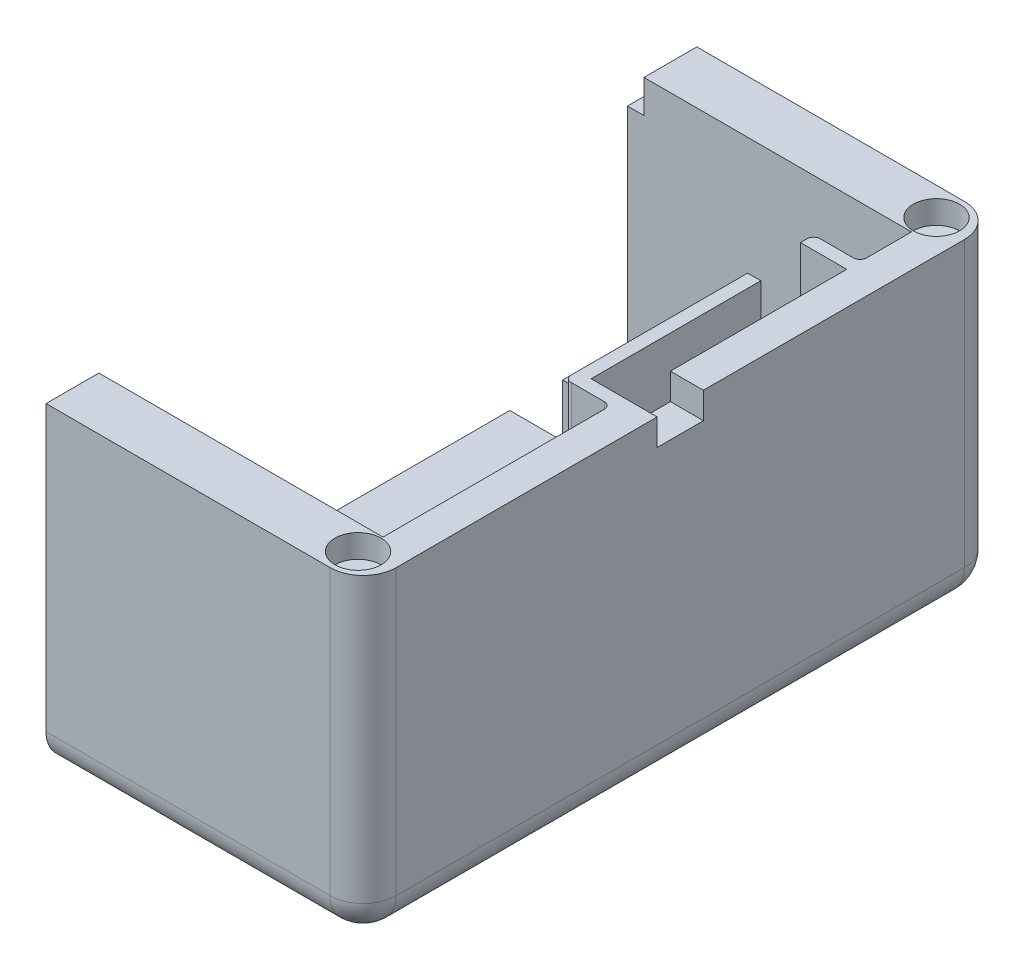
from build123d import *

# Parameters (mm, degrees)
SKETCH1_W                = 48
SKETCH1_H                = 48
BOSS_EXTRUDE1_DEPTH      = 8
BOSS_EXTRUDE2_DEPTH      = 80
SKETCH3_W                = 48
SKETCH3_H                = 48
BOSS_EXTRUDE3_DEPTH      = 8
FILLET1_R                = 5
SKETCH4_W                = 7
SKETCH4_H                = 4
CUT_EXTRUDE1_DEPTH       = 10
BOSS_EXTRUDE4_DEPTH      = 7
SKETCH6_W                = 2
SKETCH6_H                = 33.69370628
BOSS_EXTRUDE5_DEPTH      = 9
SKETCH8_W                = 8
SKETCH8_H                = 9
CUT_EXTRUDE2_DEPTH       = 5
SKETCH12_R               = 3.5
CUT_EXTRUDE9_DEPTH       = 3.5
MIRROR3_COPY_1_SKETCH_R  = 3.5
MIRROR3_COPY_1_DEPTH     = 3.5
SKETCH13_W               = 2.5
SKETCH13_H               = 5
CUT_EXTRUDE10_DEPTH      = 10
SKETCH16_R               = 1.59
CUT_EXTRUDE12_DEPTH      = 22.5
BOSS_EXTRUDE6_DEPTH      = 5
BOSS_EXTRUDE6_DEPTH_BACK = 5
SKETCH17_R               = 1.59
BOSS_EXTRUDE7_DEPTH      = 2
BOSS_EXTRUDE7_DEPTH_BACK = 5
SKETCH18_R               = 2.5
SKETCH19_R               = 1.75
CUT_EXTRUDE13_DEPTH      = 3
FILLET2_R                = 1
FILLET3_R                = 1
BOSS_EXTRUDE8_REACH      = 108.79
SKETCH21_R               = 1.59


with BuildPart() as part:
    # Sketch1 → Boss-Extrude1 (new body)
    with BuildSketch(Plane.XY):
        with Locations((1.44697784, 15.25)):
            Rectangle(SKETCH1_W, SKETCH1_H)
    extrude(amount=BOSS_EXTRUDE1_DEPTH)

    # Sketch2 → Boss-Extrude2 (add)
    with BuildSketch(Plane.XY.offset(8)):
        Polygon((-22.55302216, -8.75), (25.44697784, -8.75), (25.44697784, -3.75), (25.44697784, 39.25), (20.44697784, 39.25), (20.44697784, -3.75), (-22.55302216, -3.75), align=None)
    extrude(amount=BOSS_EXTRUDE2_DEPTH)

    # Sketch3 → Boss-Extrude3 (add)
    with BuildSketch(Plane.XY.offset(88)):
        with Locations((1.44697784, 15.25)):
            Rectangle(SKETCH3_W, SKETCH3_H)
    extrude(amount=BOSS_EXTRUDE3_DEPTH)

    # Fillet1
    fillet1_edges = [part.edges().sort_by_distance(p)[0] for p in [
        (1.44697784, -8.75, 96),
        (25.44697784, 15.25, 96),
        (25.44697784, 15.25, 0),
        (1.44697784, -8.75, 0),
        (25.44697784, -8.75, 48),
    ]]
    fillet(fillet1_edges, radius=FILLET1_R)

    # Sketch4 → Cut-Extrude1 (cut)
    with BuildSketch(Plane(origin=(25.44697784, 0, 0), x_dir=(0, 0, -1), z_dir=(1, 0, 0))):
        with Locations((-48, 37.25)):
            Rectangle(SKETCH4_W, SKETCH4_H)
    cut_extrude1 = extrude(amount=-CUT_EXTRUDE1_DEPTH, mode=Mode.SUBTRACT)

    # Sketch5 → Boss-Extrude4 (add)
    with BuildSketch(Plane.ZY.offset(-20.44697784)):
        Polygon((53.5, 39.25), (51.5, 39.25), (51.5, 35.25), (51.5, 30.25), (17.80629372, 30.25), (17.80629372, 39.25), (15.80629372, 39.25), (15.80629372, 28.25), (53.5, 28.25), align=None)
    boss_extrude4 = extrude(amount=BOSS_EXTRUDE4_DEPTH)

    # Sketch6 → Boss-Extrude5 (add)
    with BuildSketch(Plane(origin=(0, 30.25, 0), x_dir=(1, 0, 0), z_dir=(0, 1, 0))):
        with Locations((14.44697784, -34.65314686)):
            Rectangle(SKETCH6_W, SKETCH6_H)
    boss_extrude5 = extrude(amount=BOSS_EXTRUDE5_DEPTH)

    # Sketch8 → Cut-Extrude2 (cut)
    with BuildSketch(Plane.ZY.offset(-13.44697784)):
        with Locations((21.80629372, 34.75)):
            Rectangle(SKETCH8_W, SKETCH8_H)
    cut_extrude2 = extrude(amount=-CUT_EXTRUDE2_DEPTH, mode=Mode.SUBTRACT)

    # Mirror1: Cut-Extrude1, Boss-Extrude4, Boss-Extrude5, Cut-Extrude2 across plane
    add(cut_extrude1.mirror(Plane(origin=(8.34848892, 8.34848892, 0), x_dir=(0, 0, 1), z_dir=(0.7071067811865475, 0.7071067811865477, 0))), mode=Mode.SUBTRACT)
    add(boss_extrude4.mirror(Plane(origin=(8.34848892, 8.34848892, 0), x_dir=(0, 0, 1), z_dir=(0.7071067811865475, 0.7071067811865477, 0))))
    add(boss_extrude5.mirror(Plane(origin=(8.34848892, 8.34848892, 0), x_dir=(0, 0, 1), z_dir=(0.7071067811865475, 0.7071067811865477, 0))))
    add(cut_extrude2.mirror(Plane(origin=(8.34848892, 8.34848892, 0), x_dir=(0, 0, 1), z_dir=(0.7071067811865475, 0.7071067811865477, 0))), mode=Mode.SUBTRACT)

    # Sketch12 → Cut-Extrude9 (cut)
    with BuildSketch(Plane(origin=(0, 39.25, 0), x_dir=(1, 0, 0), z_dir=(0, 1, 0))):
        with Locations(Location((20.44697784, -91.770217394, 0), (0, 0, 270))):
            Circle(SKETCH12_R)
    cut_extrude9 = extrude(amount=-CUT_EXTRUDE9_DEPTH, mode=Mode.SUBTRACT)

    # Mirror2: Cut-Extrude9 across plane
    add(cut_extrude9.mirror(Plane(origin=(8.34848892, 8.34848892, 0), x_dir=(0, 0, 1), z_dir=(0.7071067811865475, 0.7071067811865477, 0))), mode=Mode.SUBTRACT)

    # Mirror3: Cut-Extrude9 across plane
    add(cut_extrude9.mirror(Plane.XY.offset(48)), mode=Mode.SUBTRACT)

    # Mirror3 copy 1 sketch → Mirror3 copy 1 (cut)
    with BuildSketch(Plane(origin=(-22.55302216, 16.69697784, 96), x_dir=(0, -1, 0), z_dir=(-1, 0, 0))):
        with Locations(Location((20.44697784, -91.770217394, 0), (0, 0, 270))):
            Circle(MIRROR3_COPY_1_SKETCH_R)
    extrude(amount=-MIRROR3_COPY_1_DEPTH, mode=Mode.SUBTRACT)

    # Sketch13 → Cut-Extrude10 (cut)
    with BuildSketch(Plane(origin=(0, 0, 0), x_dir=(-1, 0, 0), z_dir=(0, 0, -1))):
        with Locations((21.30302216, 36.75)):
            Rectangle(SKETCH13_W, SKETCH13_H)
    extrude(amount=-CUT_EXTRUDE10_DEPTH, mode=Mode.SUBTRACT)

    # Sketch16 → Cut-Extrude12 (cut, symmetric)
    with BuildSketch(Plane(origin=(50.785385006, 4.582668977, 79.35), x_dir=(-1, 0, 0), z_dir=(0, 0, -1))):
        with Locations(Location((55.728407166, 7.487331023, 0), (0, 0, 270))):
            Circle(SKETCH16_R)
    extrude(amount=CUT_EXTRUDE12_DEPTH, both=True, mode=Mode.SUBTRACT)

    # Sketch17 → Boss-Extrude6 (add, two sides: drawn at the far end of the back side and taken through both)
    with BuildSketch(Plane(origin=(0, 0, 88), x_dir=(-1, 0, 0), z_dir=(0, 0, -1)).offset(-BOSS_EXTRUDE6_DEPTH_BACK)):
        with Locations(Location((4.94302216, 12.07, 0), (0, 0, 270))):
            Circle(SKETCH17_R)
    extrude(amount=BOSS_EXTRUDE6_DEPTH + BOSS_EXTRUDE6_DEPTH_BACK)

    # Sketch18 → Boss-Extrude7 (add, two sides: drawn at the far end of the back side and taken through both)
    with BuildSketch(Plane(origin=(0, 0, 83), x_dir=(-1, 0, 0), z_dir=(0, 0, -1)).offset(-BOSS_EXTRUDE7_DEPTH_BACK)):
        with Locations((4.94302216, 12.07)):
            Circle(SKETCH18_R)
    extrude(amount=BOSS_EXTRUDE7_DEPTH + BOSS_EXTRUDE7_DEPTH_BACK)

    # Sketch19 → Cut-Extrude13 (cut)
    with BuildSketch(Plane(origin=(0, 0, 81), x_dir=(-1, 0, 0), z_dir=(0, 0, -1))):
        with Locations((4.94302216, 12.07)):
            Circle(SKETCH19_R)
    extrude(amount=-CUT_EXTRUDE13_DEPTH, mode=Mode.SUBTRACT)

    # Fillet2
    fillet2_edges = [part.edges().sort_by_distance(p)[0] for p in [
        (-17.05302216, 3.25, 53.5),
        (-11.55302216, -3.75, 34.65314686),
        (-17.05302216, 3.25, 15.80629372),
        (-11.55302216, -0.25, 15.80629372),
        (-11.55302216, 3.25, 34.65314686),
        (-17.05302216, -3.75, 15.80629372),
        (-17.05302216, -3.75, 53.5),
    ]]
    fillet(fillet2_edges, radius=FILLET2_R)

    # Fillet3
    fillet3_edges = [part.edges().sort_by_distance(p)[0] for p in [
        (20.44697784, 33.75, 15.80629372),
        (13.44697784, 28.25, 34.65314686),
        (20.44697784, 33.75, 53.5),
        (16.94697784, 28.25, 53.5),
        (13.44697784, 33.75, 15.80629372),
        (13.44697784, 33.75, 53.5),
        (20.44697784, 28.25, 34.65314686),
    ]]
    fillet(fillet3_edges, radius=FILLET3_R)

    # Sketch21 → Boss-Extrude8 (add, up to next)
    with BuildSketch(Plane.XY.offset(96), mode=Mode.PRIVATE) as boss_extrude8_sk1:
        with Locations((-4.94302216, 12.07)):
            Circle(SKETCH21_R)
    boss_extrude8_tool1 = extrude(boss_extrude8_sk1.sketch, amount=-BOSS_EXTRUDE8_REACH, mode=Mode.PRIVATE) - part.part
    add(boss_extrude8_tool1.solids().sort_by_distance((-4.943022, 12.07, 96))[0])


solid = part.part
